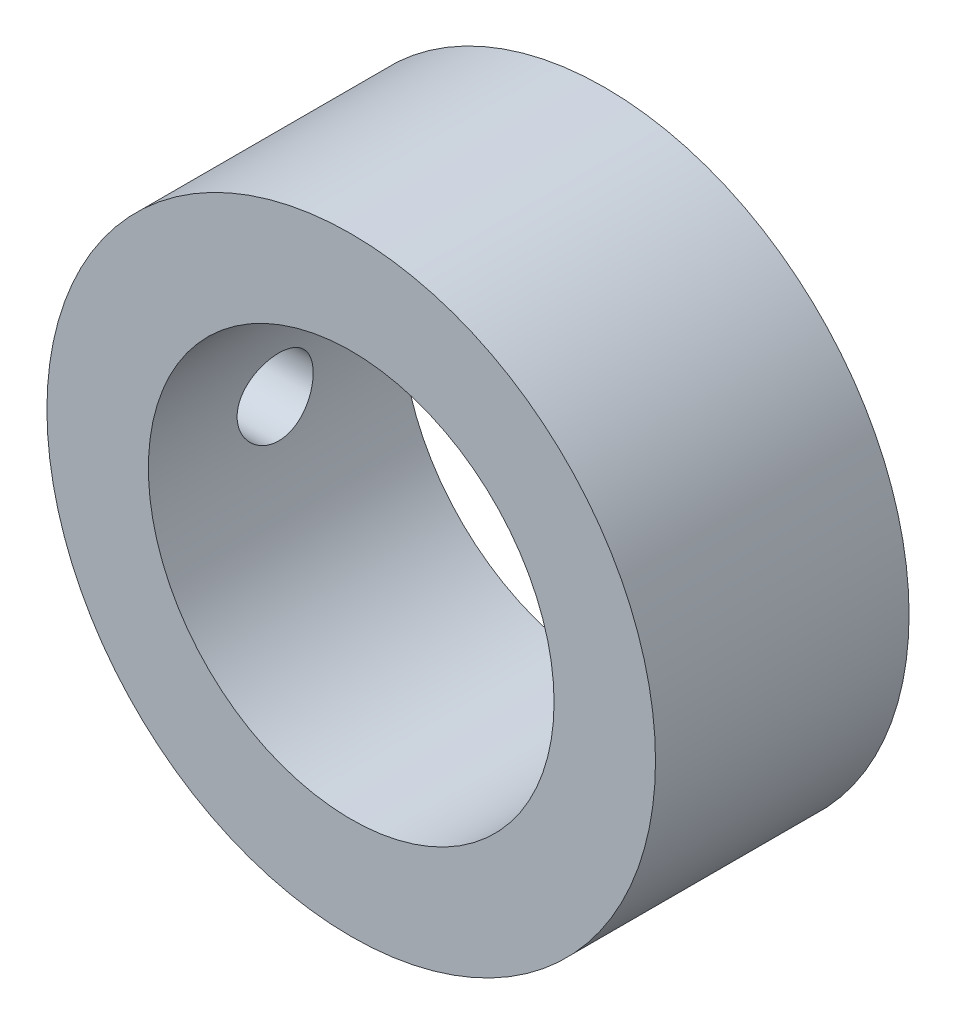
from build123d import *

# Parameters (mm, degrees)
ESQUISSE1_R        = 6
ESQUISSE1_R_2      = 4
BOSS_EXTRU_1_DEPTH = 5
PER_AGE1_D         = 1.5
PER_AGE1_DEPTH     = 5
PER_AGE1_TIP       = 0.450645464


with BuildPart() as part:
    # Esquisse1 → Boss.-Extru.1 (new body)
    with BuildSketch(Plane.XY):
        Circle(ESQUISSE1_R)
        Circle(ESQUISSE1_R_2, mode=Mode.SUBTRACT)
    extrude(amount=BOSS_EXTRU_1_DEPTH)

    # Per_age1
    with Locations(Plane.ZY.offset(6)):
        with Locations((2.5, 0)):
            Hole(PER_AGE1_D / 2, depth=PER_AGE1_DEPTH)
            with Locations((0, 0, -(PER_AGE1_DEPTH + PER_AGE1_TIP / 2))):  # 118° drill point
                Cone(0, PER_AGE1_D / 2, PER_AGE1_TIP, mode=Mode.SUBTRACT)


solid = part.part
